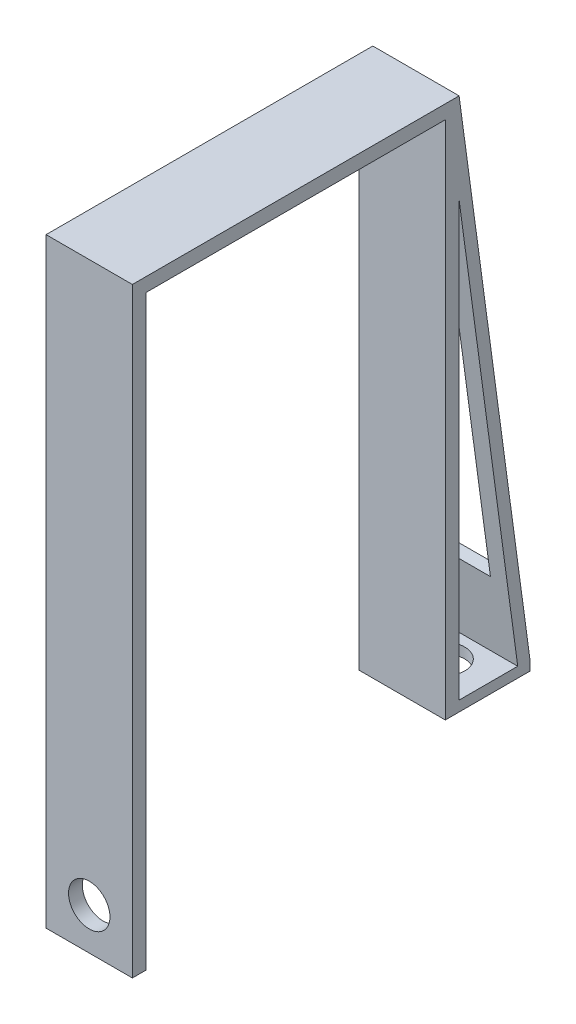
from build123d import *

# Parameters (mm, degrees)
SKETCH2_W           = 25
SKETCH2_H           = 170
SKETCH2_R           = 6
BOSS_EXTRUDE1_DEPTH = 4
SKETCH3_W           = 25
SKETCH3_H           = 90.65
BOSS_EXTRUDE2_DEPTH = 4
SKETCH5_W           = 25
SKETCH5_H           = 154.6
BOSS_EXTRUDE3_DEPTH = 4
SKETCH6_W           = 20.513424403
SKETCH6_H           = 3
BOSS_EXTRUDE4_DEPTH = 25
BOSS_EXTRUDE6_DEPTH = 25
SKETCH12_R          = 6
CUT_EXTRUDE2_DEPTH  = 4
SKETCH13_W          = 15
SKETCH13_H          = 105.358848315
CUT_EXTRUDE3_DEPTH  = 10


with BuildPart() as part:
    # Sketch2 → Boss-Extrude1 (new body)
    with BuildSketch(Plane.XY):
        with Locations((-110.703410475, -12.423873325)):
            Rectangle(SKETCH2_W, SKETCH2_H)
        with Locations((-110.703410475, -85.374562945)):
            Circle(SKETCH2_R, mode=Mode.SUBTRACT)
    extrude(amount=BOSS_EXTRUDE1_DEPTH)

    # Sketch3 → Boss-Extrude2 (add)
    with BuildSketch(Plane(origin=(0, 72.576126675, 0), x_dir=(1, 0, 0), z_dir=(0, 1, 0))):
        with Locations((-110.703410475, 41.325)):
            Rectangle(SKETCH3_W, SKETCH3_H)
    extrude(amount=BOSS_EXTRUDE2_DEPTH)

    # Sketch5 → Boss-Extrude3 (add)
    with BuildSketch(Plane(origin=(0, 0, -86.65), x_dir=(-1, 0, 0), z_dir=(0, 0, -1))):
        with Locations((110.703410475, -0.723873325)):
            Rectangle(SKETCH5_W, SKETCH5_H)
    extrude(amount=BOSS_EXTRUDE3_DEPTH)

    # Sketch6 → Boss-Extrude4 (add)
    with BuildSketch(Plane.ZY.offset(123.203410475)):
        with Locations((-100.906712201, -76.523873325)):
            Rectangle(SKETCH6_W, SKETCH6_H)
    extrude(amount=-BOSS_EXTRUDE4_DEPTH)

    # Sketch8 → Boss-Extrude6 (add)
    with BuildSketch(Plane(origin=(-98.203410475, 0, 0), x_dir=(0, 0, -1), z_dir=(1, 0, 0))):
        Polygon((90.65, 76.576126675), (111.163424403, -75.023873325), (107.631528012, -75.023873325), (90.65, 50.474414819), align=None)
    extrude(amount=-BOSS_EXTRUDE6_DEPTH)

    # Sketch12 → Cut-Extrude2 (cut)
    with BuildSketch(Plane(origin=(0, -78.023873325, 0), x_dir=(-1, 0, 0), z_dir=(0, -1, 0))):
        with Locations(Location((110.703410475, 98.781712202, 0), (0, 0, 90))):
            Circle(SKETCH12_R)
    extrude(amount=-CUT_EXTRUDE2_DEPTH, mode=Mode.SUBTRACT)

    # Sketch13 → Cut-Extrude3 (cut)
    with BuildSketch(Plane(origin=(0, 12.953106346, -95.72711428), x_dir=(1, 0, 0), z_dir=(0, -0.13409082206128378, 0.9909690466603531))):
        with Locations((-110.703410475, -14.462217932)):
            Rectangle(SKETCH13_W, SKETCH13_H)
    extrude(amount=-CUT_EXTRUDE3_DEPTH, mode=Mode.SUBTRACT)


solid = part.part
